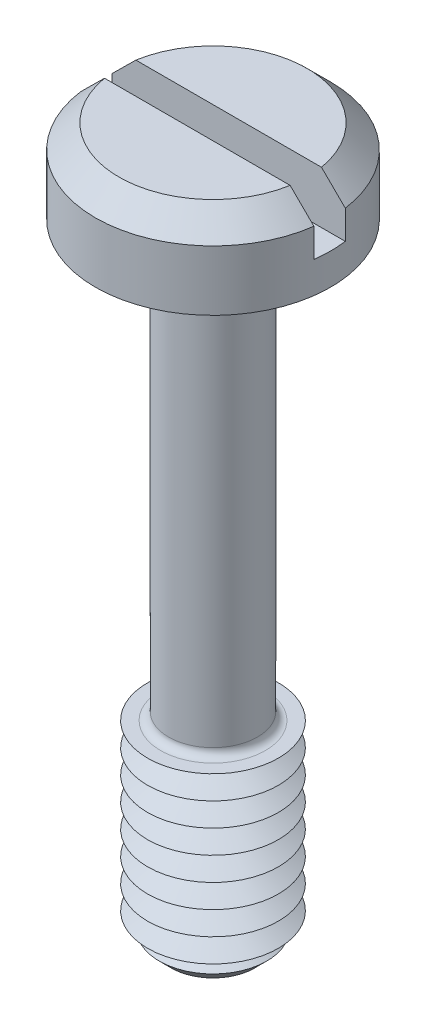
ISO-10303-21;
HEADER;
FILE_DESCRIPTION(('STEP AP214'),'2;1');
FILE_NAME('part.step','',(''),(''),'','','');
FILE_SCHEMA(('AUTOMOTIVE_DESIGN { 1 0 10303 214 1 1 1 1 }'));
ENDSEC;
DATA;
#1=APPLICATION_CONTEXT('core data for automotive mechanical design processes');
#2=APPLICATION_PROTOCOL_DEFINITION('international standard','automotive_design',2000,#1);
#3=PRODUCT_CONTEXT('',#1,'mechanical');
#4=PRODUCT('Part','Part','',(#3));
#5=PRODUCT_RELATED_PRODUCT_CATEGORY('part','',(#4));
#6=PRODUCT_DEFINITION_FORMATION('','',#4);
#7=PRODUCT_DEFINITION_CONTEXT('part definition',#1,'design');
#8=PRODUCT_DEFINITION('design','',#6,#7);
#9=PRODUCT_DEFINITION_SHAPE('','',#8);
#10=(LENGTH_UNIT() NAMED_UNIT(*) SI_UNIT(.MILLI.,.METRE.));
#11=(NAMED_UNIT(*) PLANE_ANGLE_UNIT() SI_UNIT($,.RADIAN.));
#12=(NAMED_UNIT(*) SI_UNIT($,.STERADIAN.) SOLID_ANGLE_UNIT());
#13=UNCERTAINTY_MEASURE_WITH_UNIT(LENGTH_MEASURE(1.E-05),#10,'distance_accuracy_value','');
#14=(GEOMETRIC_REPRESENTATION_CONTEXT(3) GLOBAL_UNCERTAINTY_ASSIGNED_CONTEXT((#13)) GLOBAL_UNIT_ASSIGNED_CONTEXT((#10,
#11,#12)) REPRESENTATION_CONTEXT('',''));
#15=CARTESIAN_POINT('',(0.,0.,0.));
#16=DIRECTION('',(0.,0.,1.));
#17=DIRECTION('',(1.,0.,0.));
#18=AXIS2_PLACEMENT_3D('',#15,#16,#17);
#19=CARTESIAN_POINT('',(0.,1.6,0.));
#20=DIRECTION('',(0.,1.,0.));
#21=DIRECTION('',(0.,0.,1.));
#22=AXIS2_PLACEMENT_3D('',#19,#20,#21);
#23=PLANE('',#22);
#24=DIRECTION('',(-1.,0.,0.));
#25=VECTOR('',#24,1.);
#26=CARTESIAN_POINT('',(2.25,1.6,-0.3));
#27=LINE('',#26,#25);
#28=CARTESIAN_POINT('',(1.77482393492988,1.6,-0.3));
#29=VERTEX_POINT('',#28);
#30=CARTESIAN_POINT('',(-1.77482393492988,1.6,-0.3));
#31=VERTEX_POINT('',#30);
#32=EDGE_CURVE('E110',#29,#31,#27,.T.);
#33=ORIENTED_EDGE('',*,*,#32,.F.);
#34=CARTESIAN_POINT('',(0.,1.6,0.));
#35=DIRECTION('',(0.,1.,0.));
#36=DIRECTION('',(0.,0.,1.));
#37=AXIS2_PLACEMENT_3D('',#34,#35,#36);
#38=CIRCLE('',#37,1.8);
#39=EDGE_CURVE('E113',#29,#31,#38,.T.);
#40=ORIENTED_EDGE('',*,*,#39,.T.);
#41=EDGE_LOOP('',(#33,#40));
#42=FACE_BOUND('',#41,.T.);
#43=ADVANCED_FACE('F39',(#42),#23,.T.);
#44=CARTESIAN_POINT('',(0.,1.6,0.));
#45=DIRECTION('',(0.,-1.,0.));
#46=DIRECTION('',(0.,0.,-1.));
#47=AXIS2_PLACEMENT_3D('',#44,#45,#46);
#48=CONICAL_SURFACE('',#47,1.8,0.785398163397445);
#49=CARTESIAN_POINT('',(4.95459224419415,-1.56366641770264,-0.3));
#50=CARTESIAN_POINT('',(4.78550585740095,-1.39489159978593,-0.3));
#51=CARTESIAN_POINT('',(4.6164059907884,-1.22613027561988,-0.3));
#52=CARTESIAN_POINT('',(4.27815962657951,-0.888649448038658,-0.3));
#53=CARTESIAN_POINT('',(4.10901312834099,-0.719929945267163,-0.3));
#54=CARTESIAN_POINT('',(3.77060374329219,-0.38249765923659,-0.3));
#55=CARTESIAN_POINT('',(3.60134083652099,-0.213784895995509,-0.3));
#56=CARTESIAN_POINT('',(3.26272497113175,0.123545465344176,-0.3));
#57=CARTESIAN_POINT('',(3.09337201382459,0.292163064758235,-0.3));
#58=CARTESIAN_POINT('',(2.74975444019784,0.633985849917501,-0.3));
#59=CARTESIAN_POINT('',(2.57548557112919,0.807186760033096,-0.3));
#60=CARTESIAN_POINT('',(2.22666801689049,1.15332162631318,-0.3));
#61=CARTESIAN_POINT('',(2.05211932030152,1.32625557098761,-0.3));
#62=CARTESIAN_POINT('',(1.78988225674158,1.58520097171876,-0.3));
#63=CARTESIAN_POINT('',(1.70241000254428,1.67143125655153,-0.3));
#64=CARTESIAN_POINT('',(1.52723599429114,1.84366185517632,-0.3));
#65=CARTESIAN_POINT('',(1.43953423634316,1.92966216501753,-0.3));
#66=CARTESIAN_POINT('',(1.26375483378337,2.10126365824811,-0.3));
#67=CARTESIAN_POINT('',(1.17567721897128,2.18686487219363,-0.3));
#68=CARTESIAN_POINT('',(0.998839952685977,2.35735922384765,-0.3));
#69=CARTESIAN_POINT('',(0.910080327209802,2.44225238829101,-0.3));
#70=CARTESIAN_POINT('',(0.796416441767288,2.54899153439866,-0.3));
#71=CARTESIAN_POINT('',(0.772225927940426,2.57159630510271,-0.3));
#72=CARTESIAN_POINT('',(0.723692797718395,2.61664290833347,-0.3));
#73=CARTESIAN_POINT('',(0.69935017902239,2.63908473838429,-0.3));
#74=CARTESIAN_POINT('',(0.65052808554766,2.68369783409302,-0.3));
#75=CARTESIAN_POINT('',(0.626049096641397,2.70586963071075,-0.3));
#76=CARTESIAN_POINT('',(0.576826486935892,2.74991696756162,-0.3));
#77=CARTESIAN_POINT('',(0.552082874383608,2.7717925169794,-0.3));
#78=CARTESIAN_POINT('',(0.495367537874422,2.82108684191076,-0.3));
#79=CARTESIAN_POINT('',(0.463281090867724,2.84837386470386,-0.3));
#80=CARTESIAN_POINT('',(0.398023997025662,2.90193742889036,-0.3));
#81=CARTESIAN_POINT('',(0.364849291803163,2.92820913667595,-0.3));
#82=CARTESIAN_POINT('',(0.313679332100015,2.96610502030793,-0.3));
#83=CARTESIAN_POINT('',(0.296293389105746,2.97854603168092,-0.3));
#84=CARTESIAN_POINT('',(0.260958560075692,3.00259516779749,-0.3));
#85=CARTESIAN_POINT('',(0.243009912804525,3.01420363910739,-0.3));
#86=CARTESIAN_POINT('',(0.206442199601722,3.0361249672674,-0.3));
#87=CARTESIAN_POINT('',(0.187826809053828,3.04644383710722,-0.3));
#88=CARTESIAN_POINT('',(0.149667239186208,3.06515059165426,-0.3));
#89=CARTESIAN_POINT('',(0.130125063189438,3.0735424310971,-0.3));
#90=CARTESIAN_POINT('',(0.0899770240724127,3.08736060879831,-0.3));
#91=CARTESIAN_POINT('',(0.0693720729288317,3.09278944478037,-0.3));
#92=CARTESIAN_POINT('',(0.0275643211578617,3.0994305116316,-0.3));
#93=CARTESIAN_POINT('',(0.0063658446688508,3.10066782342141,-0.3));
#94=CARTESIAN_POINT('',(-0.0358007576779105,3.09861060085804,-0.3));
#95=CARTESIAN_POINT('',(-0.0567687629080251,3.09531379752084,-0.3));
#96=CARTESIAN_POINT('',(-0.0978737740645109,3.08507807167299,-0.3));
#97=CARTESIAN_POINT('',(-0.118004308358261,3.07811501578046,-0.3));
#98=CARTESIAN_POINT('',(-0.162483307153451,3.05957916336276,-0.3));
#99=CARTESIAN_POINT('',(-0.186511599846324,3.04727044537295,-0.3));
#100=CARTESIAN_POINT('',(-0.233318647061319,3.02043354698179,-0.3));
#101=CARTESIAN_POINT('',(-0.256093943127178,3.00589960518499,-0.3));
#102=CARTESIAN_POINT('',(-0.300901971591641,2.97541580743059,-0.3));
#103=CARTESIAN_POINT('',(-0.322928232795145,2.95945657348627,-0.3));
#104=CARTESIAN_POINT('',(-0.366316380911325,2.92672827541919,-0.3));
#105=CARTESIAN_POINT('',(-0.387679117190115,2.90996032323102,-0.3));
#106=CARTESIAN_POINT('',(-0.433394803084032,2.87310399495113,-0.3));
#107=CARTESIAN_POINT('',(-0.457669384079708,2.85291891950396,-0.3));
#108=CARTESIAN_POINT('',(-0.505802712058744,2.81205752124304,-0.3));
#109=CARTESIAN_POINT('',(-0.529661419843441,2.79138115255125,-0.3));
#110=CARTESIAN_POINT('',(-0.60081134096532,2.72884009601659,-0.3));
#111=CARTESIAN_POINT('',(-0.64766190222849,2.68647545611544,-0.3));
#112=CARTESIAN_POINT('',(-0.740776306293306,2.60099002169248,-0.3));
#113=CARTESIAN_POINT('',(-0.787039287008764,2.55786829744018,-0.3));
#114=CARTESIAN_POINT('',(-0.879151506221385,2.47120207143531,-0.3));
#115=CARTESIAN_POINT('',(-0.925000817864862,2.4276576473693,-0.3));
#116=CARTESIAN_POINT('',(-1.0615734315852,2.29718252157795,-0.3));
#117=CARTESIAN_POINT('',(-1.15191647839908,2.20985470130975,-0.3));
#118=CARTESIAN_POINT('',(-1.33204374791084,2.0347474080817,-0.3));
#119=CARTESIAN_POINT('',(-1.42182830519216,1.94696827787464,-0.3));
#120=CARTESIAN_POINT('',(-1.65511823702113,1.71815111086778,-0.3));
#121=CARTESIAN_POINT('',(-1.79840096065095,1.57688614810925,-0.3));
#122=CARTESIAN_POINT('',(-2.08462326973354,1.2940074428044,-0.3));
#123=CARTESIAN_POINT('',(-2.22756285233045,1.15239369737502,-0.3));
#124=CARTESIAN_POINT('',(-2.6561839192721,0.727177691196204,-0.3));
#125=CARTESIAN_POINT('',(-2.94157972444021,0.443287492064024,-0.3));
#126=CARTESIAN_POINT('',(-3.51504981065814,-0.127735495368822,-0.3));
#127=CARTESIAN_POINT('',(-3.80312108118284,-0.414871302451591,-0.3));
#128=CARTESIAN_POINT('',(-4.37899985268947,-0.98921931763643,-0.3));
#129=CARTESIAN_POINT('',(-4.6668074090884,-1.27643147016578,-0.3));
#130=CARTESIAN_POINT('',(-4.95459224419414,-1.56366641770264,-0.3));
#131=B_SPLINE_CURVE_WITH_KNOTS('',3,(#49,#50,#51,#52,#53,#54,#55,#56,#57,#58,#59,#60,#61,#62,
#63,#64,#65,#66,#67,#68,#69,#70,#71,#72,#73,#74,#75,#76,#77,#78,#79,#80,#81,#82,#83,#84,#85,#86,
#87,#88,#89,#90,#91,#92,#93,#94,#95,#96,#97,#98,#99,#100,#101,#102,#103,#104,#105,#106,#107,
#108,#109,#110,#111,#112,#113,#114,#115,#116,#117,#118,#119,#120,#121,#122,#123,#124,#125,#126,
#127,#128,#129,#130),.UNSPECIFIED.,.F.,.F.,(4,2,2,2,2,2,2,2,2,2,2,2,2,2,2,2,2,2,2,2,2,2,2,2,2,2,
2,2,2,2,2,2,2,2,2,2,2,2,2,2,4),(0.,0.716712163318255,1.43343474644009,2.1503903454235,
2.86733577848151,3.6044339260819,4.3415629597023,4.71005096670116,5.07854526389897,
5.44701086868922,5.81546249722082,5.91478669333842,6.01411239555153,6.11319302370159,
6.21227057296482,6.33862193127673,6.46551497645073,6.52963544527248,6.59372906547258,
6.65751170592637,6.72116225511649,6.78475906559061,6.84797465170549,6.91122188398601,
6.97489074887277,7.05566851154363,7.13665907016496,7.21822852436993,7.29968885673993,
7.39438996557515,7.48909995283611,7.67857624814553,7.86830424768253,8.05799801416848,
8.43494407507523,8.81163695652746,9.41526715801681,10.0189023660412,11.2265436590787,
12.4467437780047,13.6665454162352),.UNSPECIFIED.);
#132=CARTESIAN_POINT('',(2.2299103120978,1.14999999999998,-0.3));
#133=VERTEX_POINT('',#132);
#134=EDGE_CURVE('E259',#133,#29,#131,.T.);
#135=ORIENTED_EDGE('',*,*,#134,.F.);
#136=CARTESIAN_POINT('',(0.,1.15,0.));
#137=DIRECTION('',(0.,1.,0.));
#138=DIRECTION('',(0.,0.,1.));
#139=AXIS2_PLACEMENT_3D('',#136,#137,#138);
#140=CIRCLE('',#139,2.25);
#141=CARTESIAN_POINT('',(-2.22991031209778,1.15,-0.3));
#142=VERTEX_POINT('',#141);
#143=EDGE_CURVE('E127',#142,#133,#140,.F.);
#144=ORIENTED_EDGE('',*,*,#143,.F.);
#145=EDGE_CURVE('E102',#31,#142,#131,.T.);
#146=ORIENTED_EDGE('',*,*,#145,.F.);
#147=ORIENTED_EDGE('',*,*,#39,.F.);
#148=EDGE_LOOP('',(#135,#144,#146,#147));
#149=FACE_BOUND('',#148,.T.);
#150=ADVANCED_FACE('F221',(#149),#48,.T.);
#151=CARTESIAN_POINT('',(0.,-12.,0.));
#152=DIRECTION('',(0.,1.,0.));
#153=DIRECTION('',(0.,0.,1.));
#154=AXIS2_PLACEMENT_3D('',#151,#152,#153);
#155=CYLINDRICAL_SURFACE('',#154,0.85);
#156=CARTESIAN_POINT('',(0.,-8.15,0.));
#157=DIRECTION('',(0.,-1.,0.));
#158=DIRECTION('',(0.,0.,-1.));
#159=AXIS2_PLACEMENT_3D('',#156,#157,#158);
#160=CIRCLE('',#159,0.85);
#161=CARTESIAN_POINT('',(0.,-8.15,-0.85));
#162=VERTEX_POINT('',#161);
#163=EDGE_CURVE('E123',#162,#162,#160,.F.);
#164=ORIENTED_EDGE('',*,*,#163,.T.);
#165=EDGE_LOOP('',(#164));
#166=FACE_BOUND('',#165,.T.);
#167=CARTESIAN_POINT('',(0.,-0.150000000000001,0.));
#168=DIRECTION('',(0.,1.,0.));
#169=DIRECTION('',(0.,0.,1.));
#170=AXIS2_PLACEMENT_3D('',#167,#168,#169);
#171=CIRCLE('',#170,0.85);
#172=CARTESIAN_POINT('',(0.,-0.150000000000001,0.85));
#173=VERTEX_POINT('',#172);
#174=EDGE_CURVE('E365',#173,#173,#171,.F.);
#175=ORIENTED_EDGE('',*,*,#174,.T.);
#176=EDGE_LOOP('',(#175));
#177=FACE_BOUND('',#176,.T.);
#178=ADVANCED_FACE('F217',(#166,#177),#155,.T.);
#179=CARTESIAN_POINT('',(0.,1.6,0.));
#180=DIRECTION('',(0.,-1.,0.));
#181=DIRECTION('',(0.,0.,-1.));
#182=AXIS2_PLACEMENT_3D('',#179,#180,#181);
#183=CYLINDRICAL_SURFACE('',#182,2.25);
#184=ORIENTED_EDGE('',*,*,#143,.T.);
#185=DIRECTION('',(0.,-1.,0.));
#186=VECTOR('',#185,1.);
#187=CARTESIAN_POINT('',(2.22991031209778,1.6,-0.3));
#188=LINE('',#187,#186);
#189=CARTESIAN_POINT('',(2.22991031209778,0.6,-0.3));
#190=VERTEX_POINT('',#189);
#191=EDGE_CURVE('E64',#133,#190,#188,.T.);
#192=ORIENTED_EDGE('',*,*,#191,.T.);
#193=CARTESIAN_POINT('',(0.,0.6,0.));
#194=DIRECTION('',(0.,1.,0.));
#195=DIRECTION('',(0.,0.,1.));
#196=AXIS2_PLACEMENT_3D('',#193,#194,#195);
#197=CIRCLE('',#196,2.25);
#198=CARTESIAN_POINT('',(2.22991031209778,0.6,0.3));
#199=VERTEX_POINT('',#198);
#200=EDGE_CURVE('E11',#199,#190,#197,.T.);
#201=ORIENTED_EDGE('',*,*,#200,.F.);
#202=DIRECTION('',(0.,-1.,0.));
#203=VECTOR('',#202,1.);
#204=CARTESIAN_POINT('',(2.22991031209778,1.6,0.3));
#205=LINE('',#204,#203);
#206=CARTESIAN_POINT('',(2.22991031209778,1.15,0.3));
#207=VERTEX_POINT('',#206);
#208=EDGE_CURVE('E277',#199,#207,#205,.F.);
#209=ORIENTED_EDGE('',*,*,#208,.T.);
#210=CARTESIAN_POINT('',(-2.2299103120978,1.14999999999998,0.3));
#211=VERTEX_POINT('',#210);
#212=EDGE_CURVE('E120',#207,#211,#140,.F.);
#213=ORIENTED_EDGE('',*,*,#212,.T.);
#214=DIRECTION('',(0.,-1.,0.));
#215=VECTOR('',#214,1.);
#216=CARTESIAN_POINT('',(-2.22991031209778,1.6,0.3));
#217=LINE('',#216,#215);
#218=CARTESIAN_POINT('',(-2.22991031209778,0.6,0.3));
#219=VERTEX_POINT('',#218);
#220=EDGE_CURVE('E96',#211,#219,#217,.T.);
#221=ORIENTED_EDGE('',*,*,#220,.T.);
#222=CARTESIAN_POINT('',(-2.22991031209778,0.6,-0.3));
#223=VERTEX_POINT('',#222);
#224=EDGE_CURVE('E44',#223,#219,#197,.T.);
#225=ORIENTED_EDGE('',*,*,#224,.F.);
#226=DIRECTION('',(0.,-1.,0.));
#227=VECTOR('',#226,1.);
#228=CARTESIAN_POINT('',(-2.22991031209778,1.6,-0.3));
#229=LINE('',#228,#227);
#230=EDGE_CURVE('E282',#223,#142,#229,.F.);
#231=ORIENTED_EDGE('',*,*,#230,.T.);
#232=EDGE_LOOP('',(#184,#192,#201,#209,#213,#221,#225,#231));
#233=FACE_BOUND('',#232,.T.);
#234=CARTESIAN_POINT('',(0.,0.,0.));
#235=DIRECTION('',(0.,1.,0.));
#236=DIRECTION('',(0.,0.,1.));
#237=AXIS2_PLACEMENT_3D('',#234,#235,#236);
#238=CIRCLE('',#237,2.25);
#239=CARTESIAN_POINT('',(0.,0.,2.25));
#240=VERTEX_POINT('',#239);
#241=EDGE_CURVE('E352',#240,#240,#238,.T.);
#242=ORIENTED_EDGE('',*,*,#241,.T.);
#243=EDGE_LOOP('',(#242));
#244=FACE_BOUND('',#243,.T.);
#245=ADVANCED_FACE('F220',(#233,#244),#183,.T.);
#246=DIRECTION('',(1.,0.,0.));
#247=VECTOR('',#246,1.);
#248=CARTESIAN_POINT('',(2.25,1.6,0.3));
#249=LINE('',#248,#247);
#250=CARTESIAN_POINT('',(-1.77482393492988,1.6,0.3));
#251=VERTEX_POINT('',#250);
#252=CARTESIAN_POINT('',(1.77482393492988,1.6,0.3));
#253=VERTEX_POINT('',#252);
#254=EDGE_CURVE('E56',#251,#253,#249,.T.);
#255=ORIENTED_EDGE('',*,*,#254,.F.);
#256=EDGE_CURVE('E108',#251,#253,#38,.T.);
#257=ORIENTED_EDGE('',*,*,#256,.T.);
#258=EDGE_LOOP('',(#255,#257));
#259=FACE_BOUND('',#258,.T.);
#260=ADVANCED_FACE('F107',(#259),#23,.T.);
#261=CARTESIAN_POINT('',(0.,0.,0.));
#262=DIRECTION('',(0.,1.,0.));
#263=DIRECTION('',(0.,0.,1.));
#264=AXIS2_PLACEMENT_3D('',#261,#262,#263);
#265=PLANE('',#264);
#266=CARTESIAN_POINT('',(0.,0.,0.));
#267=DIRECTION('',(0.,1.,0.));
#268=DIRECTION('',(0.,0.,1.));
#269=AXIS2_PLACEMENT_3D('',#266,#267,#268);
#270=CIRCLE('',#269,1.);
#271=CARTESIAN_POINT('',(0.,0.,1.));
#272=VERTEX_POINT('',#271);
#273=EDGE_CURVE('E114',#272,#272,#270,.T.);
#274=ORIENTED_EDGE('',*,*,#273,.T.);
#275=EDGE_LOOP('',(#274));
#276=FACE_BOUND('',#275,.T.);
#277=ORIENTED_EDGE('',*,*,#241,.F.);
#278=EDGE_LOOP('',(#277));
#279=FACE_BOUND('',#278,.T.);
#280=ADVANCED_FACE('F211',(#276,#279),#265,.F.);
#281=CARTESIAN_POINT('',(0.,-8.3,0.));
#282=DIRECTION('',(0.,-1.,0.));
#283=DIRECTION('',(0.,0.,-1.));
#284=AXIS2_PLACEMENT_3D('',#281,#282,#283);
#285=PLANE('',#284);
#286=CARTESIAN_POINT('',(0.,-8.3,0.));
#287=DIRECTION('',(0.,-1.,0.));
#288=DIRECTION('',(0.,0.,-1.));
#289=AXIS2_PLACEMENT_3D('',#286,#287,#288);
#290=CIRCLE('',#289,1.);
#291=CARTESIAN_POINT('',(0.,-8.3,-1.));
#292=VERTEX_POINT('',#291);
#293=EDGE_CURVE('E359',#292,#292,#290,.T.);
#294=ORIENTED_EDGE('',*,*,#293,.T.);
#295=EDGE_LOOP('',(#294));
#296=FACE_BOUND('',#295,.T.);
#297=CARTESIAN_POINT('',(0.,-8.3,0.));
#298=DIRECTION('',(0.,1.,0.));
#299=DIRECTION('',(0.,0.,1.));
#300=AXIS2_PLACEMENT_3D('',#297,#298,#299);
#301=CIRCLE('',#300,1.25);
#302=CARTESIAN_POINT('',(0.,-8.3,1.25));
#303=VERTEX_POINT('',#302);
#304=EDGE_CURVE('E348',#303,#303,#301,.T.);
#305=ORIENTED_EDGE('',*,*,#304,.T.);
#306=EDGE_LOOP('',(#305));
#307=FACE_BOUND('',#306,.T.);
#308=ADVANCED_FACE('F207',(#296,#307),#285,.F.);
#309=CARTESIAN_POINT('',(0.,-8.525,0.));
#310=DIRECTION('',(0.,1.,0.));
#311=DIRECTION('',(0.,0.,1.));
#312=AXIS2_PLACEMENT_3D('',#309,#310,#311);
#313=CONICAL_SURFACE('',#312,0.860288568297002,1.0471975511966);
#314=ORIENTED_EDGE('',*,*,#304,.F.);
#315=EDGE_LOOP('',(#314));
#316=FACE_BOUND('',#315,.T.);
#317=CARTESIAN_POINT('',(0.,-8.525,0.));
#318=DIRECTION('',(0.,1.,0.));
#319=DIRECTION('',(0.,0.,1.));
#320=AXIS2_PLACEMENT_3D('',#317,#318,#319);
#321=CIRCLE('',#320,0.860288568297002);
#322=CARTESIAN_POINT('',(0.,-8.525,0.860288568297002));
#323=VERTEX_POINT('',#322);
#324=EDGE_CURVE('E344',#323,#323,#321,.T.);
#325=ORIENTED_EDGE('',*,*,#324,.T.);
#326=EDGE_LOOP('',(#325));
#327=FACE_BOUND('',#326,.T.);
#328=ADVANCED_FACE('F203',(#316,#327),#313,.T.);
#329=CARTESIAN_POINT('',(0.,-8.75,0.));
#330=DIRECTION('',(0.,-1.,0.));
#331=DIRECTION('',(0.,0.,-1.));
#332=AXIS2_PLACEMENT_3D('',#329,#330,#331);
#333=CONICAL_SURFACE('',#332,1.25,1.0471975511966);
#334=ORIENTED_EDGE('',*,*,#324,.F.);
#335=EDGE_LOOP('',(#334));
#336=FACE_BOUND('',#335,.T.);
#337=CARTESIAN_POINT('',(0.,-8.75,0.));
#338=DIRECTION('',(0.,1.,0.));
#339=DIRECTION('',(0.,0.,1.));
#340=AXIS2_PLACEMENT_3D('',#337,#338,#339);
#341=CIRCLE('',#340,1.25);
#342=CARTESIAN_POINT('',(0.,-8.75,1.25));
#343=VERTEX_POINT('',#342);
#344=EDGE_CURVE('E340',#343,#343,#341,.T.);
#345=ORIENTED_EDGE('',*,*,#344,.T.);
#346=EDGE_LOOP('',(#345));
#347=FACE_BOUND('',#346,.T.);
#348=ADVANCED_FACE('F199',(#336,#347),#333,.T.);
#349=CARTESIAN_POINT('',(0.,-8.975,0.));
#350=DIRECTION('',(0.,1.,0.));
#351=DIRECTION('',(0.,0.,1.));
#352=AXIS2_PLACEMENT_3D('',#349,#350,#351);
#353=CONICAL_SURFACE('',#352,0.860288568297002,1.0471975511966);
#354=ORIENTED_EDGE('',*,*,#344,.F.);
#355=EDGE_LOOP('',(#354));
#356=FACE_BOUND('',#355,.T.);
#357=CARTESIAN_POINT('',(0.,-8.975,0.));
#358=DIRECTION('',(0.,1.,0.));
#359=DIRECTION('',(0.,0.,1.));
#360=AXIS2_PLACEMENT_3D('',#357,#358,#359);
#361=CIRCLE('',#360,0.860288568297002);
#362=CARTESIAN_POINT('',(0.,-8.975,0.860288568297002));
#363=VERTEX_POINT('',#362);
#364=EDGE_CURVE('E336',#363,#363,#361,.T.);
#365=ORIENTED_EDGE('',*,*,#364,.T.);
#366=EDGE_LOOP('',(#365));
#367=FACE_BOUND('',#366,.T.);
#368=ADVANCED_FACE('F195',(#356,#367),#353,.T.);
#369=CARTESIAN_POINT('',(0.,-9.2,0.));
#370=DIRECTION('',(0.,-1.,0.));
#371=DIRECTION('',(0.,0.,-1.));
#372=AXIS2_PLACEMENT_3D('',#369,#370,#371);
#373=CONICAL_SURFACE('',#372,1.25,1.0471975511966);
#374=ORIENTED_EDGE('',*,*,#364,.F.);
#375=EDGE_LOOP('',(#374));
#376=FACE_BOUND('',#375,.T.);
#377=CARTESIAN_POINT('',(0.,-9.2,0.));
#378=DIRECTION('',(0.,1.,0.));
#379=DIRECTION('',(0.,0.,1.));
#380=AXIS2_PLACEMENT_3D('',#377,#378,#379);
#381=CIRCLE('',#380,1.25);
#382=CARTESIAN_POINT('',(0.,-9.2,1.25));
#383=VERTEX_POINT('',#382);
#384=EDGE_CURVE('E333',#383,#383,#381,.T.);
#385=ORIENTED_EDGE('',*,*,#384,.T.);
#386=EDGE_LOOP('',(#385));
#387=FACE_BOUND('',#386,.T.);
#388=ADVANCED_FACE('F191',(#376,#387),#373,.T.);
#389=CARTESIAN_POINT('',(0.,-9.425,0.));
#390=DIRECTION('',(0.,1.,0.));
#391=DIRECTION('',(0.,0.,1.));
#392=AXIS2_PLACEMENT_3D('',#389,#390,#391);
#393=CONICAL_SURFACE('',#392,0.860288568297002,1.0471975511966);
#394=ORIENTED_EDGE('',*,*,#384,.F.);
#395=EDGE_LOOP('',(#394));
#396=FACE_BOUND('',#395,.T.);
#397=CARTESIAN_POINT('',(0.,-9.425,0.));
#398=DIRECTION('',(0.,1.,0.));
#399=DIRECTION('',(0.,0.,1.));
#400=AXIS2_PLACEMENT_3D('',#397,#398,#399);
#401=CIRCLE('',#400,0.860288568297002);
#402=CARTESIAN_POINT('',(0.,-9.425,0.860288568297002));
#403=VERTEX_POINT('',#402);
#404=EDGE_CURVE('E330',#403,#403,#401,.T.);
#405=ORIENTED_EDGE('',*,*,#404,.T.);
#406=EDGE_LOOP('',(#405));
#407=FACE_BOUND('',#406,.T.);
#408=ADVANCED_FACE('F187',(#396,#407),#393,.T.);
#409=CARTESIAN_POINT('',(0.,-9.65,0.));
#410=DIRECTION('',(0.,-1.,0.));
#411=DIRECTION('',(0.,0.,-1.));
#412=AXIS2_PLACEMENT_3D('',#409,#410,#411);
#413=CONICAL_SURFACE('',#412,1.25,1.0471975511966);
#414=ORIENTED_EDGE('',*,*,#404,.F.);
#415=EDGE_LOOP('',(#414));
#416=FACE_BOUND('',#415,.T.);
#417=CARTESIAN_POINT('',(0.,-9.65,0.));
#418=DIRECTION('',(0.,1.,0.));
#419=DIRECTION('',(0.,0.,1.));
#420=AXIS2_PLACEMENT_3D('',#417,#418,#419);
#421=CIRCLE('',#420,1.25);
#422=CARTESIAN_POINT('',(0.,-9.65,1.25));
#423=VERTEX_POINT('',#422);
#424=EDGE_CURVE('E326',#423,#423,#421,.T.);
#425=ORIENTED_EDGE('',*,*,#424,.T.);
#426=EDGE_LOOP('',(#425));
#427=FACE_BOUND('',#426,.T.);
#428=ADVANCED_FACE('F183',(#416,#427),#413,.T.);
#429=CARTESIAN_POINT('',(0.,-9.875,0.));
#430=DIRECTION('',(0.,1.,0.));
#431=DIRECTION('',(0.,0.,1.));
#432=AXIS2_PLACEMENT_3D('',#429,#430,#431);
#433=CONICAL_SURFACE('',#432,0.860288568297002,1.0471975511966);
#434=ORIENTED_EDGE('',*,*,#424,.F.);
#435=EDGE_LOOP('',(#434));
#436=FACE_BOUND('',#435,.T.);
#437=CARTESIAN_POINT('',(0.,-9.875,0.));
#438=DIRECTION('',(0.,1.,0.));
#439=DIRECTION('',(0.,0.,1.));
#440=AXIS2_PLACEMENT_3D('',#437,#438,#439);
#441=CIRCLE('',#440,0.860288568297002);
#442=CARTESIAN_POINT('',(0.,-9.875,0.860288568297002));
#443=VERTEX_POINT('',#442);
#444=EDGE_CURVE('E322',#443,#443,#441,.T.);
#445=ORIENTED_EDGE('',*,*,#444,.T.);
#446=EDGE_LOOP('',(#445));
#447=FACE_BOUND('',#446,.T.);
#448=ADVANCED_FACE('F179',(#436,#447),#433,.T.);
#449=CARTESIAN_POINT('',(0.,-10.1,0.));
#450=DIRECTION('',(0.,-1.,0.));
#451=DIRECTION('',(0.,0.,-1.));
#452=AXIS2_PLACEMENT_3D('',#449,#450,#451);
#453=CONICAL_SURFACE('',#452,1.25,1.0471975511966);
#454=ORIENTED_EDGE('',*,*,#444,.F.);
#455=EDGE_LOOP('',(#454));
#456=FACE_BOUND('',#455,.T.);
#457=CARTESIAN_POINT('',(0.,-10.1,0.));
#458=DIRECTION('',(0.,1.,0.));
#459=DIRECTION('',(0.,0.,1.));
#460=AXIS2_PLACEMENT_3D('',#457,#458,#459);
#461=CIRCLE('',#460,1.25);
#462=CARTESIAN_POINT('',(0.,-10.1,1.25));
#463=VERTEX_POINT('',#462);
#464=EDGE_CURVE('E318',#463,#463,#461,.T.);
#465=ORIENTED_EDGE('',*,*,#464,.T.);
#466=EDGE_LOOP('',(#465));
#467=FACE_BOUND('',#466,.T.);
#468=ADVANCED_FACE('F175',(#456,#467),#453,.T.);
#469=CARTESIAN_POINT('',(0.,-10.325,0.));
#470=DIRECTION('',(0.,1.,0.));
#471=DIRECTION('',(0.,0.,1.));
#472=AXIS2_PLACEMENT_3D('',#469,#470,#471);
#473=CONICAL_SURFACE('',#472,0.860288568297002,1.0471975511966);
#474=ORIENTED_EDGE('',*,*,#464,.F.);
#475=EDGE_LOOP('',(#474));
#476=FACE_BOUND('',#475,.T.);
#477=CARTESIAN_POINT('',(0.,-10.325,0.));
#478=DIRECTION('',(0.,1.,0.));
#479=DIRECTION('',(0.,0.,1.));
#480=AXIS2_PLACEMENT_3D('',#477,#478,#479);
#481=CIRCLE('',#480,0.860288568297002);
#482=CARTESIAN_POINT('',(0.,-10.325,0.860288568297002));
#483=VERTEX_POINT('',#482);
#484=EDGE_CURVE('E315',#483,#483,#481,.T.);
#485=ORIENTED_EDGE('',*,*,#484,.T.);
#486=EDGE_LOOP('',(#485));
#487=FACE_BOUND('',#486,.T.);
#488=ADVANCED_FACE('F171',(#476,#487),#473,.T.);
#489=CARTESIAN_POINT('',(0.,-10.55,0.));
#490=DIRECTION('',(0.,-1.,0.));
#491=DIRECTION('',(0.,0.,-1.));
#492=AXIS2_PLACEMENT_3D('',#489,#490,#491);
#493=CONICAL_SURFACE('',#492,1.25,1.0471975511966);
#494=ORIENTED_EDGE('',*,*,#484,.F.);
#495=EDGE_LOOP('',(#494));
#496=FACE_BOUND('',#495,.T.);
#497=CARTESIAN_POINT('',(0.,-10.55,0.));
#498=DIRECTION('',(0.,1.,0.));
#499=DIRECTION('',(0.,0.,1.));
#500=AXIS2_PLACEMENT_3D('',#497,#498,#499);
#501=CIRCLE('',#500,1.25);
#502=CARTESIAN_POINT('',(0.,-10.55,1.25));
#503=VERTEX_POINT('',#502);
#504=EDGE_CURVE('E311',#503,#503,#501,.T.);
#505=ORIENTED_EDGE('',*,*,#504,.T.);
#506=EDGE_LOOP('',(#505));
#507=FACE_BOUND('',#506,.T.);
#508=ADVANCED_FACE('F167',(#496,#507),#493,.T.);
#509=CARTESIAN_POINT('',(0.,-10.775,0.));
#510=DIRECTION('',(0.,1.,0.));
#511=DIRECTION('',(0.,0.,1.));
#512=AXIS2_PLACEMENT_3D('',#509,#510,#511);
#513=CONICAL_SURFACE('',#512,0.860288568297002,1.0471975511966);
#514=ORIENTED_EDGE('',*,*,#504,.F.);
#515=EDGE_LOOP('',(#514));
#516=FACE_BOUND('',#515,.T.);
#517=CARTESIAN_POINT('',(0.,-10.775,0.));
#518=DIRECTION('',(0.,1.,0.));
#519=DIRECTION('',(0.,0.,1.));
#520=AXIS2_PLACEMENT_3D('',#517,#518,#519);
#521=CIRCLE('',#520,0.860288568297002);
#522=CARTESIAN_POINT('',(0.,-10.775,0.860288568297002));
#523=VERTEX_POINT('',#522);
#524=EDGE_CURVE('E308',#523,#523,#521,.T.);
#525=ORIENTED_EDGE('',*,*,#524,.T.);
#526=EDGE_LOOP('',(#525));
#527=FACE_BOUND('',#526,.T.);
#528=ADVANCED_FACE('F163',(#516,#527),#513,.T.);
#529=CARTESIAN_POINT('',(0.,-11.,0.));
#530=DIRECTION('',(0.,-1.,0.));
#531=DIRECTION('',(0.,0.,-1.));
#532=AXIS2_PLACEMENT_3D('',#529,#530,#531);
#533=CONICAL_SURFACE('',#532,1.25,1.0471975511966);
#534=ORIENTED_EDGE('',*,*,#524,.F.);
#535=EDGE_LOOP('',(#534));
#536=FACE_BOUND('',#535,.T.);
#537=CARTESIAN_POINT('',(0.,-11.,0.));
#538=DIRECTION('',(0.,1.,0.));
#539=DIRECTION('',(0.,0.,1.));
#540=AXIS2_PLACEMENT_3D('',#537,#538,#539);
#541=CIRCLE('',#540,1.25);
#542=CARTESIAN_POINT('',(0.,-11.,1.25));
#543=VERTEX_POINT('',#542);
#544=EDGE_CURVE('E304',#543,#543,#541,.T.);
#545=ORIENTED_EDGE('',*,*,#544,.T.);
#546=EDGE_LOOP('',(#545));
#547=FACE_BOUND('',#546,.T.);
#548=ADVANCED_FACE('F159',(#536,#547),#533,.T.);
#549=CARTESIAN_POINT('',(0.,-11.225,0.));
#550=DIRECTION('',(0.,1.,0.));
#551=DIRECTION('',(0.,0.,1.));
#552=AXIS2_PLACEMENT_3D('',#549,#550,#551);
#553=CONICAL_SURFACE('',#552,0.860288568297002,1.0471975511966);
#554=ORIENTED_EDGE('',*,*,#544,.F.);
#555=EDGE_LOOP('',(#554));
#556=FACE_BOUND('',#555,.T.);
#557=CARTESIAN_POINT('',(0.,-11.225,0.));
#558=DIRECTION('',(0.,1.,0.));
#559=DIRECTION('',(0.,0.,1.));
#560=AXIS2_PLACEMENT_3D('',#557,#558,#559);
#561=CIRCLE('',#560,0.860288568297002);
#562=CARTESIAN_POINT('',(0.,-11.225,0.860288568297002));
#563=VERTEX_POINT('',#562);
#564=EDGE_CURVE('E300',#563,#563,#561,.T.);
#565=ORIENTED_EDGE('',*,*,#564,.T.);
#566=EDGE_LOOP('',(#565));
#567=FACE_BOUND('',#566,.T.);
#568=ADVANCED_FACE('F155',(#556,#567),#553,.T.);
#569=CARTESIAN_POINT('',(0.,-11.45,0.));
#570=DIRECTION('',(0.,-1.,0.));
#571=DIRECTION('',(0.,0.,-1.));
#572=AXIS2_PLACEMENT_3D('',#569,#570,#571);
#573=CONICAL_SURFACE('',#572,1.25,1.0471975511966);
#574=ORIENTED_EDGE('',*,*,#564,.F.);
#575=EDGE_LOOP('',(#574));
#576=FACE_BOUND('',#575,.T.);
#577=CARTESIAN_POINT('',(0.,-11.45,0.));
#578=DIRECTION('',(0.,1.,0.));
#579=DIRECTION('',(0.,0.,1.));
#580=AXIS2_PLACEMENT_3D('',#577,#578,#579);
#581=CIRCLE('',#580,1.25);
#582=CARTESIAN_POINT('',(0.,-11.45,1.25));
#583=VERTEX_POINT('',#582);
#584=EDGE_CURVE('E295',#583,#583,#581,.T.);
#585=ORIENTED_EDGE('',*,*,#584,.T.);
#586=EDGE_LOOP('',(#585));
#587=FACE_BOUND('',#586,.T.);
#588=ADVANCED_FACE('F151',(#576,#587),#573,.T.);
#589=CARTESIAN_POINT('',(0.,-11.675,0.));
#590=DIRECTION('',(0.,1.,0.));
#591=DIRECTION('',(0.,0.,1.));
#592=AXIS2_PLACEMENT_3D('',#589,#590,#591);
#593=CONICAL_SURFACE('',#592,0.860288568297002,1.0471975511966);
#594=ORIENTED_EDGE('',*,*,#584,.F.);
#595=EDGE_LOOP('',(#594));
#596=FACE_BOUND('',#595,.T.);
#597=CARTESIAN_POINT('',(0.,-11.675,0.));
#598=DIRECTION('',(0.,1.,0.));
#599=DIRECTION('',(0.,0.,1.));
#600=AXIS2_PLACEMENT_3D('',#597,#598,#599);
#601=CIRCLE('',#600,0.860288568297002);
#602=CARTESIAN_POINT('',(0.,-11.675,0.860288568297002));
#603=VERTEX_POINT('',#602);
#604=EDGE_CURVE('E292',#603,#603,#601,.T.);
#605=ORIENTED_EDGE('',*,*,#604,.T.);
#606=EDGE_LOOP('',(#605));
#607=FACE_BOUND('',#606,.T.);
#608=ADVANCED_FACE('F147',(#596,#607),#593,.T.);
#609=CARTESIAN_POINT('',(0.,-11.9,0.));
#610=DIRECTION('',(0.,-1.,0.));
#611=DIRECTION('',(0.,0.,-1.));
#612=AXIS2_PLACEMENT_3D('',#609,#610,#611);
#613=CONICAL_SURFACE('',#612,1.25,1.0471975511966);
#614=CARTESIAN_POINT('',(0.,-11.7718911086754,0.));
#615=DIRECTION('',(0.,-1.,0.));
#616=DIRECTION('',(0.,0.,-1.));
#617=AXIS2_PLACEMENT_3D('',#614,#615,#616);
#618=CIRCLE('',#617,1.02810889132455);
#619=CARTESIAN_POINT('',(0.,-11.7718911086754,-1.02810889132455));
#620=VERTEX_POINT('',#619);
#621=EDGE_CURVE('E299',#620,#620,#618,.F.);
#622=ORIENTED_EDGE('',*,*,#621,.T.);
#623=EDGE_LOOP('',(#622));
#624=FACE_BOUND('',#623,.T.);
#625=ORIENTED_EDGE('',*,*,#604,.F.);
#626=EDGE_LOOP('',(#625));
#627=FACE_BOUND('',#626,.T.);
#628=ADVANCED_FACE('F143',(#624,#627),#613,.T.);
#629=CARTESIAN_POINT('',(0.,-12.,0.));
#630=DIRECTION('',(0.,-1.,0.));
#631=DIRECTION('',(0.,0.,-1.));
#632=AXIS2_PLACEMENT_3D('',#629,#630,#631);
#633=PLANE('',#632);
#634=CARTESIAN_POINT('',(0.,-12.,0.));
#635=DIRECTION('',(0.,-1.,0.));
#636=DIRECTION('',(0.,0.,-1.));
#637=AXIS2_PLACEMENT_3D('',#634,#635,#636);
#638=CIRCLE('',#637,0.8);
#639=CARTESIAN_POINT('',(0.,-12.,-0.8));
#640=VERTEX_POINT('',#639);
#641=EDGE_CURVE('E356',#640,#640,#638,.T.);
#642=ORIENTED_EDGE('',*,*,#641,.T.);
#643=EDGE_LOOP('',(#642));
#644=FACE_BOUND('',#643,.T.);
#645=ADVANCED_FACE('F146',(#644),#633,.T.);
#646=CARTESIAN_POINT('',(0.,-12.,0.));
#647=DIRECTION('',(0.,1.,0.));
#648=DIRECTION('',(0.,0.,1.));
#649=AXIS2_PLACEMENT_3D('',#646,#647,#648);
#650=CONICAL_SURFACE('',#649,0.8,0.785398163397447);
#651=ORIENTED_EDGE('',*,*,#621,.F.);
#652=EDGE_LOOP('',(#651));
#653=FACE_BOUND('',#652,.T.);
#654=ORIENTED_EDGE('',*,*,#641,.F.);
#655=EDGE_LOOP('',(#654));
#656=FACE_BOUND('',#655,.T.);
#657=ADVANCED_FACE('F215',(#653,#656),#650,.T.);
#658=CARTESIAN_POINT('',(0.,-8.15,0.));
#659=DIRECTION('',(0.,-1.,0.));
#660=DIRECTION('',(0.,0.,-1.));
#661=AXIS2_PLACEMENT_3D('',#658,#659,#660);
#662=TOROIDAL_SURFACE('',#661,1.,0.15);
#663=ORIENTED_EDGE('',*,*,#163,.F.);
#664=EDGE_LOOP('',(#663));
#665=FACE_BOUND('',#664,.T.);
#666=ORIENTED_EDGE('',*,*,#293,.F.);
#667=EDGE_LOOP('',(#666));
#668=FACE_BOUND('',#667,.T.);
#669=ADVANCED_FACE('F233',(#665,#668),#662,.F.);
#670=CARTESIAN_POINT('',(0.,-0.150000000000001,0.));
#671=DIRECTION('',(0.,1.,0.));
#672=DIRECTION('',(0.,0.,1.));
#673=AXIS2_PLACEMENT_3D('',#670,#671,#672);
#674=TOROIDAL_SURFACE('',#673,1.,0.15);
#675=ORIENTED_EDGE('',*,*,#273,.F.);
#676=EDGE_LOOP('',(#675));
#677=FACE_BOUND('',#676,.T.);
#678=ORIENTED_EDGE('',*,*,#174,.F.);
#679=EDGE_LOOP('',(#678));
#680=FACE_BOUND('',#679,.T.);
#681=ADVANCED_FACE('F236',(#677,#680),#674,.F.);
#682=CARTESIAN_POINT('',(-4.95459224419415,-1.56366641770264,0.3));
#683=CARTESIAN_POINT('',(-4.78550585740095,-1.39489159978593,0.3));
#684=CARTESIAN_POINT('',(-4.6164059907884,-1.22613027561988,0.3));
#685=CARTESIAN_POINT('',(-4.27815962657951,-0.888649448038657,0.3));
#686=CARTESIAN_POINT('',(-4.10901312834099,-0.719929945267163,0.3));
#687=CARTESIAN_POINT('',(-3.77060374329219,-0.38249765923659,0.3));
#688=CARTESIAN_POINT('',(-3.60134083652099,-0.21378489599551,0.3));
#689=CARTESIAN_POINT('',(-3.26272497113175,0.123545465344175,0.3));
#690=CARTESIAN_POINT('',(-3.09337201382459,0.292163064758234,0.3));
#691=CARTESIAN_POINT('',(-2.74975444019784,0.6339858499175,0.3));
#692=CARTESIAN_POINT('',(-2.57548557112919,0.807186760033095,0.3));
#693=CARTESIAN_POINT('',(-2.22666801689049,1.15332162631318,0.3));
#694=CARTESIAN_POINT('',(-2.05211932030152,1.32625557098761,0.3));
#695=CARTESIAN_POINT('',(-1.78988225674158,1.58520097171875,0.3));
#696=CARTESIAN_POINT('',(-1.70241000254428,1.67143125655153,0.3));
#697=CARTESIAN_POINT('',(-1.52723599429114,1.84366185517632,0.3));
#698=CARTESIAN_POINT('',(-1.43953423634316,1.92966216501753,0.3));
#699=CARTESIAN_POINT('',(-1.26375483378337,2.10126365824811,0.3));
#700=CARTESIAN_POINT('',(-1.17567721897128,2.18686487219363,0.3));
#701=CARTESIAN_POINT('',(-0.998839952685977,2.35735922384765,0.3));
#702=CARTESIAN_POINT('',(-0.910080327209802,2.44225238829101,0.3));
#703=CARTESIAN_POINT('',(-0.796416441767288,2.54899153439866,0.3));
#704=CARTESIAN_POINT('',(-0.772225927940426,2.57159630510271,0.3));
#705=CARTESIAN_POINT('',(-0.723692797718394,2.61664290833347,0.3));
#706=CARTESIAN_POINT('',(-0.699350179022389,2.63908473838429,0.3));
#707=CARTESIAN_POINT('',(-0.650528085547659,2.68369783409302,0.3));
#708=CARTESIAN_POINT('',(-0.626049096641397,2.70586963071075,0.3));
#709=CARTESIAN_POINT('',(-0.576826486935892,2.74991696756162,0.3));
#710=CARTESIAN_POINT('',(-0.552082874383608,2.7717925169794,0.3));
#711=CARTESIAN_POINT('',(-0.495367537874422,2.82108684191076,0.3));
#712=CARTESIAN_POINT('',(-0.463281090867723,2.84837386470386,0.3));
#713=CARTESIAN_POINT('',(-0.398023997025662,2.90193742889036,0.3));
#714=CARTESIAN_POINT('',(-0.364849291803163,2.92820913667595,0.3));
#715=CARTESIAN_POINT('',(-0.313679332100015,2.96610502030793,0.3));
#716=CARTESIAN_POINT('',(-0.296293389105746,2.97854603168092,0.3));
#717=CARTESIAN_POINT('',(-0.260958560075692,3.00259516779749,0.3));
#718=CARTESIAN_POINT('',(-0.243009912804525,3.01420363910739,0.3));
#719=CARTESIAN_POINT('',(-0.206442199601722,3.0361249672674,0.3));
#720=CARTESIAN_POINT('',(-0.187826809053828,3.04644383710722,0.3));
#721=CARTESIAN_POINT('',(-0.149667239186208,3.06515059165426,0.3));
#722=CARTESIAN_POINT('',(-0.130125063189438,3.0735424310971,0.3));
#723=CARTESIAN_POINT('',(-0.0899770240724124,3.08736060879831,0.3));
#724=CARTESIAN_POINT('',(-0.0693720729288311,3.09278944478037,0.3));
#725=CARTESIAN_POINT('',(-0.027564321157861,3.0994305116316,0.3));
#726=CARTESIAN_POINT('',(-0.00636584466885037,3.10066782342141,0.3));
#727=CARTESIAN_POINT('',(0.0358007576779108,3.09861060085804,0.3));
#728=CARTESIAN_POINT('',(0.0567687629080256,3.09531379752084,0.3));
#729=CARTESIAN_POINT('',(0.0978737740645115,3.08507807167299,0.3));
#730=CARTESIAN_POINT('',(0.118004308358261,3.07811501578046,0.3));
#731=CARTESIAN_POINT('',(0.162483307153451,3.05957916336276,0.3));
#732=CARTESIAN_POINT('',(0.186511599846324,3.04727044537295,0.3));
#733=CARTESIAN_POINT('',(0.233318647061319,3.02043354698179,0.3));
#734=CARTESIAN_POINT('',(0.256093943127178,3.00589960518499,0.3));
#735=CARTESIAN_POINT('',(0.300901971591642,2.97541580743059,0.3));
#736=CARTESIAN_POINT('',(0.322928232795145,2.95945657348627,0.3));
#737=CARTESIAN_POINT('',(0.366316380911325,2.92672827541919,0.3));
#738=CARTESIAN_POINT('',(0.387679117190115,2.90996032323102,0.3));
#739=CARTESIAN_POINT('',(0.433394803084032,2.87310399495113,0.3));
#740=CARTESIAN_POINT('',(0.457669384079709,2.85291891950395,0.3));
#741=CARTESIAN_POINT('',(0.505802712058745,2.81205752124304,0.3));
#742=CARTESIAN_POINT('',(0.529661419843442,2.79138115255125,0.3));
#743=CARTESIAN_POINT('',(0.600811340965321,2.72884009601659,0.3));
#744=CARTESIAN_POINT('',(0.647661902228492,2.68647545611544,0.3));
#745=CARTESIAN_POINT('',(0.740776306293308,2.60099002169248,0.3));
#746=CARTESIAN_POINT('',(0.787039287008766,2.55786829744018,0.3));
#747=CARTESIAN_POINT('',(0.879151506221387,2.47120207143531,0.3));
#748=CARTESIAN_POINT('',(0.925000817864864,2.42765764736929,0.3));
#749=CARTESIAN_POINT('',(1.0615734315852,2.29718252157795,0.3));
#750=CARTESIAN_POINT('',(1.15191647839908,2.20985470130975,0.3));
#751=CARTESIAN_POINT('',(1.33204374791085,2.0347474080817,0.3));
#752=CARTESIAN_POINT('',(1.42182830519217,1.94696827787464,0.3));
#753=CARTESIAN_POINT('',(1.65511823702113,1.71815111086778,0.3));
#754=CARTESIAN_POINT('',(1.79840096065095,1.57688614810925,0.3));
#755=CARTESIAN_POINT('',(2.08462326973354,1.2940074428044,0.3));
#756=CARTESIAN_POINT('',(2.22756285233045,1.15239369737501,0.3));
#757=CARTESIAN_POINT('',(2.6561839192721,0.727177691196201,0.3));
#758=CARTESIAN_POINT('',(2.94157972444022,0.443287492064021,0.3));
#759=CARTESIAN_POINT('',(3.51504981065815,-0.127735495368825,0.3));
#760=CARTESIAN_POINT('',(3.80312108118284,-0.414871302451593,0.3));
#761=CARTESIAN_POINT('',(4.37899985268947,-0.989219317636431,0.3));
#762=CARTESIAN_POINT('',(4.6668074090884,-1.27643147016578,0.3));
#763=CARTESIAN_POINT('',(4.95459224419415,-1.56366641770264,0.3));
#764=B_SPLINE_CURVE_WITH_KNOTS('',3,(#682,#683,#684,#685,#686,#687,#688,#689,#690,#691,#692,
#693,#694,#695,#696,#697,#698,#699,#700,#701,#702,#703,#704,#705,#706,#707,#708,#709,#710,#711,
#712,#713,#714,#715,#716,#717,#718,#719,#720,#721,#722,#723,#724,#725,#726,#727,#728,#729,#730,
#731,#732,#733,#734,#735,#736,#737,#738,#739,#740,#741,#742,#743,#744,#745,#746,#747,#748,#749,
#750,#751,#752,#753,#754,#755,#756,#757,#758,#759,#760,#761,#762,#763),.UNSPECIFIED.,.F.,.F.,(4,
2,2,2,2,2,2,2,2,2,2,2,2,2,2,2,2,2,2,2,2,2,2,2,2,2,2,2,2,2,2,2,2,2,2,2,2,2,2,2,4),(0.,
0.716712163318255,1.43343474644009,2.1503903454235,2.8673357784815,3.6044339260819,
4.3415629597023,4.71005096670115,5.07854526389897,5.44701086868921,5.81546249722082,
5.91478669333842,6.01411239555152,6.11319302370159,6.21227057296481,6.33862193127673,
6.46551497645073,6.52963544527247,6.59372906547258,6.65751170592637,6.72116225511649,
6.78475906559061,6.84797465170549,6.91122188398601,6.97489074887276,7.05566851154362,
7.13665907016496,7.21822852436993,7.29968885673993,7.39438996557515,7.48909995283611,
7.67857624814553,7.86830424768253,8.05799801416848,8.43494407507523,8.81163695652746,
9.41526715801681,10.0189023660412,11.2265436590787,12.4467437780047,13.6665454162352),.UNSPECIFIED.);
#765=EDGE_CURVE('E92',#211,#251,#764,.T.);
#766=ORIENTED_EDGE('',*,*,#765,.F.);
#767=ORIENTED_EDGE('',*,*,#212,.F.);
#768=EDGE_CURVE('E103',#253,#207,#764,.T.);
#769=ORIENTED_EDGE('',*,*,#768,.F.);
#770=ORIENTED_EDGE('',*,*,#256,.F.);
#771=EDGE_LOOP('',(#766,#767,#769,#770));
#772=FACE_BOUND('',#771,.T.);
#773=ADVANCED_FACE('F41',(#772),#48,.T.);
#774=CARTESIAN_POINT('',(0.,0.6,0.));
#775=DIRECTION('',(0.,1.,0.));
#776=DIRECTION('',(0.,0.,1.));
#777=AXIS2_PLACEMENT_3D('',#774,#775,#776);
#778=PLANE('',#777);
#779=DIRECTION('',(1.,0.,0.));
#780=VECTOR('',#779,1.);
#781=CARTESIAN_POINT('',(2.25,0.6,0.3));
#782=LINE('',#781,#780);
#783=EDGE_CURVE('E256',#219,#199,#782,.T.);
#784=ORIENTED_EDGE('',*,*,#783,.T.);
#785=ORIENTED_EDGE('',*,*,#200,.T.);
#786=DIRECTION('',(-1.,0.,0.));
#787=VECTOR('',#786,1.);
#788=CARTESIAN_POINT('',(2.25,0.6,-0.3));
#789=LINE('',#788,#787);
#790=EDGE_CURVE('E274',#190,#223,#789,.T.);
#791=ORIENTED_EDGE('',*,*,#790,.T.);
#792=ORIENTED_EDGE('',*,*,#224,.T.);
#793=EDGE_LOOP('',(#784,#785,#791,#792));
#794=FACE_BOUND('',#793,.T.);
#795=ADVANCED_FACE('F243',(#794),#778,.T.);
#796=CARTESIAN_POINT('',(2.25,0.6,-0.3));
#797=DIRECTION('',(0.,0.,-1.));
#798=DIRECTION('',(-1.,0.,0.));
#799=AXIS2_PLACEMENT_3D('',#796,#797,#798);
#800=PLANE('',#799);
#801=ORIENTED_EDGE('',*,*,#134,.T.);
#802=ORIENTED_EDGE('',*,*,#32,.T.);
#803=ORIENTED_EDGE('',*,*,#145,.T.);
#804=ORIENTED_EDGE('',*,*,#230,.F.);
#805=ORIENTED_EDGE('',*,*,#790,.F.);
#806=ORIENTED_EDGE('',*,*,#191,.F.);
#807=EDGE_LOOP('',(#801,#802,#803,#804,#805,#806));
#808=FACE_BOUND('',#807,.T.);
#809=ADVANCED_FACE('F140',(#808),#800,.F.);
#810=CARTESIAN_POINT('',(2.25,0.6,0.3));
#811=DIRECTION('',(0.,0.,1.));
#812=DIRECTION('',(1.,0.,0.));
#813=AXIS2_PLACEMENT_3D('',#810,#811,#812);
#814=PLANE('',#813);
#815=ORIENTED_EDGE('',*,*,#765,.T.);
#816=ORIENTED_EDGE('',*,*,#254,.T.);
#817=ORIENTED_EDGE('',*,*,#768,.T.);
#818=ORIENTED_EDGE('',*,*,#208,.F.);
#819=ORIENTED_EDGE('',*,*,#783,.F.);
#820=ORIENTED_EDGE('',*,*,#220,.F.);
#821=EDGE_LOOP('',(#815,#816,#817,#818,#819,#820));
#822=FACE_BOUND('',#821,.T.);
#823=ADVANCED_FACE('F93',(#822),#814,.F.);
#824=CLOSED_SHELL('',(#43,#150,#178,#245,#260,#280,#308,#328,#348,#368,#388,#408,#428,#448,#468,
#488,#508,#528,#548,#568,#588,#608,#628,#645,#657,#669,#681,#773,#795,#809,#823));
#825=MANIFOLD_SOLID_BREP('B2',#824);
#826=ADVANCED_BREP_SHAPE_REPRESENTATION('',(#18,#825),#14);
#827=SHAPE_DEFINITION_REPRESENTATION(#9,#826);
ENDSEC;
END-ISO-10303-21;
